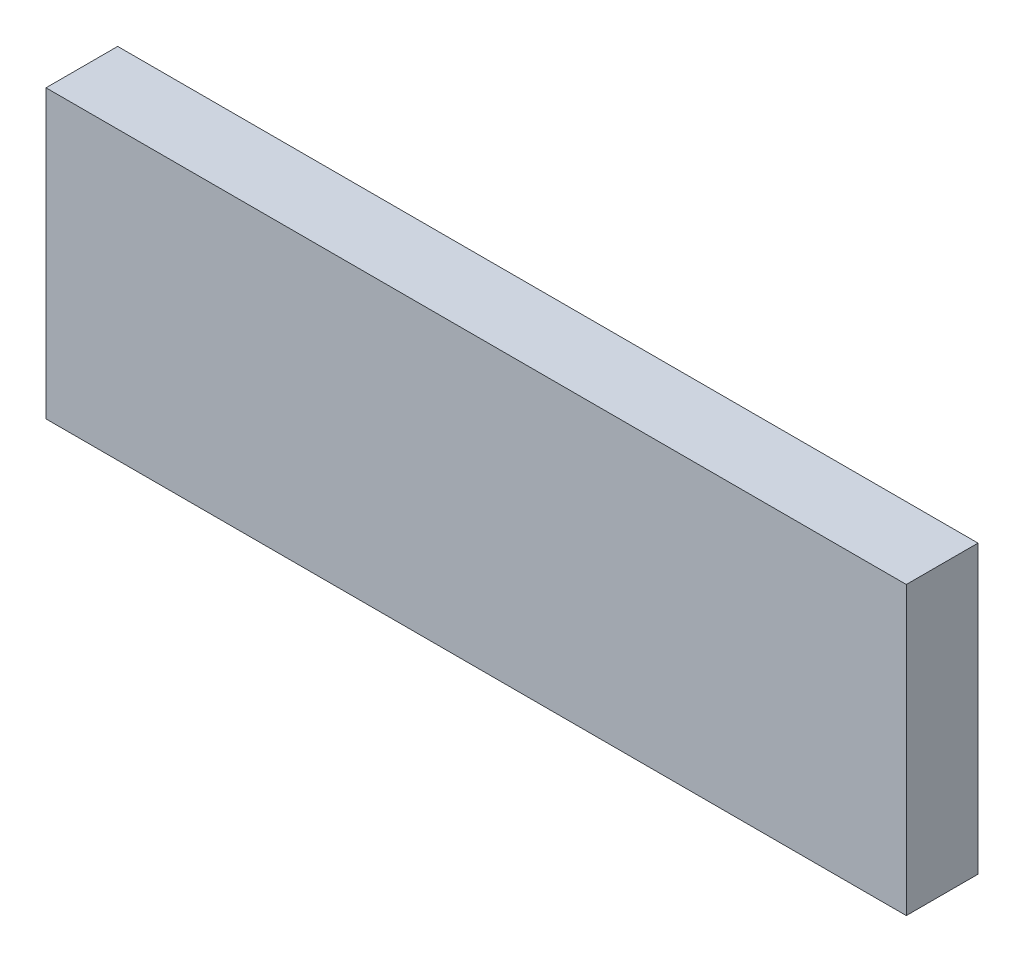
from build123d import *

# Parameters (mm, degrees)
SKETCH1_W           = 60
SKETCH1_H           = 20
BOSS_EXTRUDE1_DEPTH = 2.5


with BuildPart() as part:
    # Sketch1 → Boss-Extrude1 (new, symmetric)
    with BuildSketch(Plane.XY):
        Rectangle(SKETCH1_W, SKETCH1_H)
    extrude(amount=BOSS_EXTRUDE1_DEPTH, both=True)


solid = part.part
